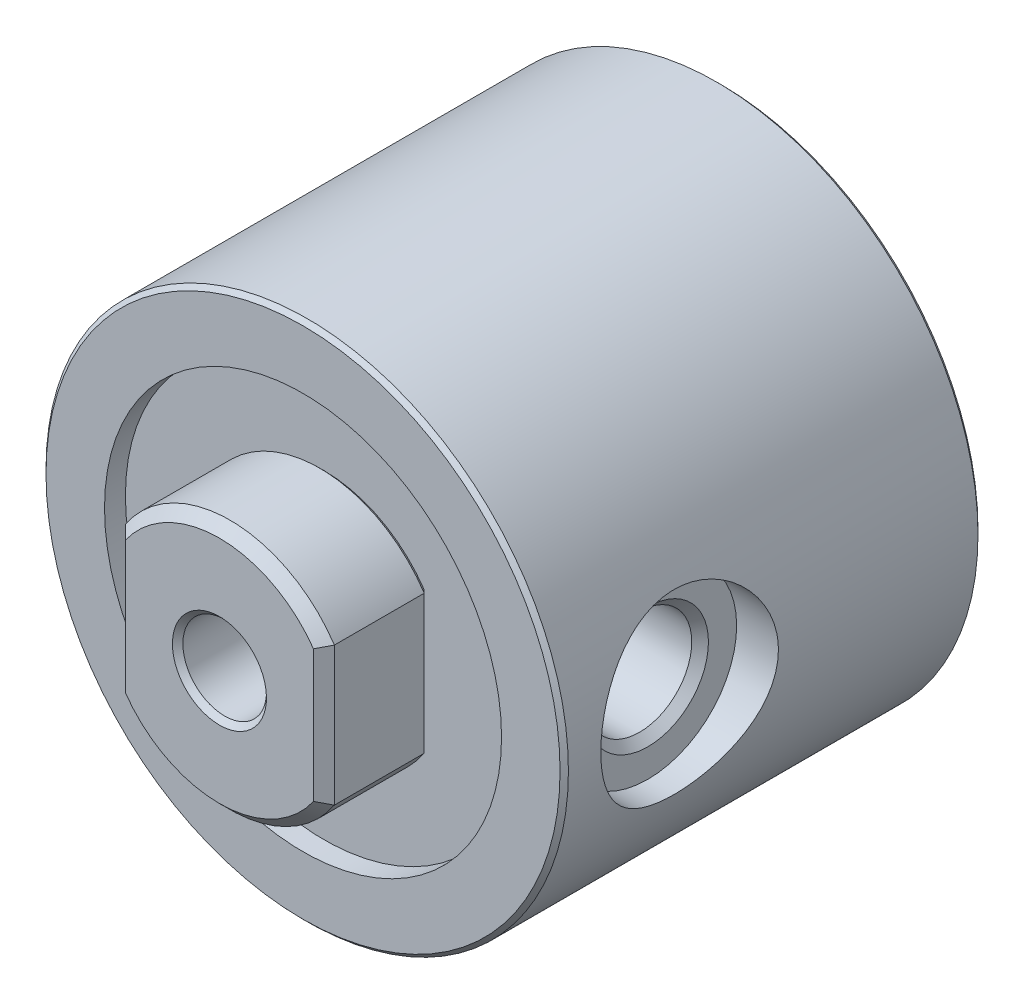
ISO-10303-21;
HEADER;
FILE_DESCRIPTION(('STEP AP214'),'2;1');
FILE_NAME('part.step','',(''),(''),'','','');
FILE_SCHEMA(('AUTOMOTIVE_DESIGN { 1 0 10303 214 1 1 1 1 }'));
ENDSEC;
DATA;
#1=APPLICATION_CONTEXT('core data for automotive mechanical design processes');
#2=APPLICATION_PROTOCOL_DEFINITION('international standard','automotive_design',2000,#1);
#3=PRODUCT_CONTEXT('',#1,'mechanical');
#4=PRODUCT('Part','Part','',(#3));
#5=PRODUCT_RELATED_PRODUCT_CATEGORY('part','',(#4));
#6=PRODUCT_DEFINITION_FORMATION('','',#4);
#7=PRODUCT_DEFINITION_CONTEXT('part definition',#1,'design');
#8=PRODUCT_DEFINITION('design','',#6,#7);
#9=PRODUCT_DEFINITION_SHAPE('','',#8);
#10=(LENGTH_UNIT() NAMED_UNIT(*) SI_UNIT(.MILLI.,.METRE.));
#11=(NAMED_UNIT(*) PLANE_ANGLE_UNIT() SI_UNIT($,.RADIAN.));
#12=(NAMED_UNIT(*) SI_UNIT($,.STERADIAN.) SOLID_ANGLE_UNIT());
#13=UNCERTAINTY_MEASURE_WITH_UNIT(LENGTH_MEASURE(1.E-05),#10,'distance_accuracy_value','');
#14=(GEOMETRIC_REPRESENTATION_CONTEXT(3) GLOBAL_UNCERTAINTY_ASSIGNED_CONTEXT((#13)) GLOBAL_UNIT_ASSIGNED_CONTEXT((#10,
#11,#12)) REPRESENTATION_CONTEXT('',''));
#15=CARTESIAN_POINT('',(0.,0.,0.));
#16=DIRECTION('',(0.,0.,1.));
#17=DIRECTION('',(1.,0.,0.));
#18=AXIS2_PLACEMENT_3D('',#15,#16,#17);
#19=CARTESIAN_POINT('',(10.5,0.,14.));
#20=DIRECTION('',(-1.,0.,0.));
#21=DIRECTION('',(0.,-1.,0.));
#22=AXIS2_PLACEMENT_3D('',#19,#20,#21);
#23=PLANE('',#22);
#24=CARTESIAN_POINT('',(10.5,0.,14.));
#25=DIRECTION('',(1.,0.,0.));
#26=DIRECTION('',(0.,0.,-1.));
#27=AXIS2_PLACEMENT_3D('',#24,#25,#26);
#28=CIRCLE('',#27,2.9);
#29=CARTESIAN_POINT('',(10.5,0.,11.1));
#30=VERTEX_POINT('',#29);
#31=EDGE_CURVE('E158',#30,#30,#28,.T.);
#32=ORIENTED_EDGE('',*,*,#31,.F.);
#33=EDGE_LOOP('',(#32));
#34=FACE_BOUND('',#33,.T.);
#35=CARTESIAN_POINT('',(10.5,0.,14.));
#36=DIRECTION('',(-1.,0.,0.));
#37=DIRECTION('',(0.,-1.,0.));
#38=AXIS2_PLACEMENT_3D('',#35,#36,#37);
#39=CIRCLE('',#38,4.25);
#40=CARTESIAN_POINT('',(10.5,-4.25,14.));
#41=VERTEX_POINT('',#40);
#42=EDGE_CURVE('E162',#41,#41,#39,.T.);
#43=ORIENTED_EDGE('',*,*,#42,.F.);
#44=EDGE_LOOP('',(#43));
#45=FACE_BOUND('',#44,.T.);
#46=ADVANCED_FACE('F14',(#34,#45),#23,.F.);
#47=CARTESIAN_POINT('',(10.5,0.,14.));
#48=DIRECTION('',(1.,0.,0.));
#49=DIRECTION('',(0.,0.,-1.));
#50=AXIS2_PLACEMENT_3D('',#47,#48,#49);
#51=CONICAL_SURFACE('',#50,2.9,0.785398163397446);
#52=CARTESIAN_POINT('',(10.1,0.,14.));
#53=DIRECTION('',(1.,0.,0.));
#54=DIRECTION('',(0.,-1.,0.));
#55=AXIS2_PLACEMENT_3D('',#52,#53,#54);
#56=CIRCLE('',#55,2.5);
#57=CARTESIAN_POINT('',(10.1,-2.5,14.));
#58=VERTEX_POINT('',#57);
#59=EDGE_CURVE('E168',#58,#58,#56,.F.);
#60=ORIENTED_EDGE('',*,*,#59,.T.);
#61=EDGE_LOOP('',(#60));
#62=FACE_BOUND('',#61,.T.);
#63=ORIENTED_EDGE('',*,*,#31,.T.);
#64=EDGE_LOOP('',(#63));
#65=FACE_BOUND('',#64,.T.);
#66=ADVANCED_FACE('F201',(#62,#65),#51,.F.);
#67=CARTESIAN_POINT('',(2.5,0.,14.));
#68=DIRECTION('',(1.,0.,0.));
#69=DIRECTION('',(0.,0.,-1.));
#70=AXIS2_PLACEMENT_3D('',#67,#68,#69);
#71=CYLINDRICAL_SURFACE('',#70,4.25);
#72=CARTESIAN_POINT('',(12.5,0.,9.75));
#73=CARTESIAN_POINT('',(12.5000013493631,-0.2316293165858,9.74999796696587));
#74=CARTESIAN_POINT('',(12.493502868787,-0.463244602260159,9.76899733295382));
#75=CARTESIAN_POINT('',(12.4682205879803,-0.919637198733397,9.84424894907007));
#76=CARTESIAN_POINT('',(12.4494359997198,-1.14441406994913,9.90050358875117));
#77=CARTESIAN_POINT('',(12.4016188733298,-1.58048439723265,10.0481034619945));
#78=CARTESIAN_POINT('',(12.3726038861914,-1.79180021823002,10.139388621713));
#79=CARTESIAN_POINT('',(12.3072763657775,-2.1961203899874,10.3541815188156));
#80=CARTESIAN_POINT('',(12.270962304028,-2.38912089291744,10.4776960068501));
#81=CARTESIAN_POINT('',(12.1933910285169,-2.75825261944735,10.7580893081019));
#82=CARTESIAN_POINT('',(12.1520119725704,-2.93363688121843,10.9159175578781));
#83=CARTESIAN_POINT('',(12.069633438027,-3.25602333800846,11.2584402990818));
#84=CARTESIAN_POINT('',(12.0286340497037,-3.40301894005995,11.4431410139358));
#85=CARTESIAN_POINT('',(11.9503048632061,-3.66879190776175,11.8409772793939));
#86=CARTESIAN_POINT('',(11.9131228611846,-3.78658554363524,12.0548019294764));
#87=CARTESIAN_POINT('',(11.8484975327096,-3.98421855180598,12.500694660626));
#88=CARTESIAN_POINT('',(11.8210510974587,-4.06407004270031,12.7327568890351));
#89=CARTESIAN_POINT('',(11.7802904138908,-4.180727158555,13.2000245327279));
#90=CARTESIAN_POINT('',(11.7665167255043,-4.21893677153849,13.4348381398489));
#91=CARTESIAN_POINT('',(11.7533040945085,-4.2556150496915,13.9079165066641));
#92=CARTESIAN_POINT('',(11.7538605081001,-4.25409658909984,14.1461801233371));
#93=CARTESIAN_POINT('',(11.7688435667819,-4.21244934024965,14.6072949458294));
#94=CARTESIAN_POINT('',(11.7826060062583,-4.1741694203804,14.8303385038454));
#95=CARTESIAN_POINT('',(11.8213609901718,-4.06310816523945,15.266625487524));
#96=CARTESIAN_POINT('',(11.8463549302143,-3.99032254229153,15.4798676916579));
#97=CARTESIAN_POINT('',(11.9052184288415,-3.81113653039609,15.8946323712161));
#98=CARTESIAN_POINT('',(11.9392282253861,-3.70419900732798,16.0959020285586));
#99=CARTESIAN_POINT('',(12.0122344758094,-3.46011773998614,16.4782170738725));
#100=CARTESIAN_POINT('',(12.0512324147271,-3.32296499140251,16.6592564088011));
#101=CARTESIAN_POINT('',(12.1324166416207,-3.01353124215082,17.006338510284));
#102=CARTESIAN_POINT('',(12.1746609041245,-2.83974395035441,17.1710276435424));
#103=CARTESIAN_POINT('',(12.2557250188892,-2.4665017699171,17.469285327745));
#104=CARTESIAN_POINT('',(12.294544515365,-2.26704421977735,17.602850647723));
#105=CARTESIAN_POINT('',(12.3649312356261,-1.84516436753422,17.8362182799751));
#106=CARTESIAN_POINT('',(12.3964165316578,-1.62251944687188,17.9356445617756));
#107=CARTESIAN_POINT('',(12.4479909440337,-1.16233553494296,18.0952073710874));
#108=CARTESIAN_POINT('',(12.4680841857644,-0.924801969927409,18.1553581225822));
#109=CARTESIAN_POINT('',(12.4939206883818,-0.453032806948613,18.2322333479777));
#110=CARTESIAN_POINT('',(12.5002675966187,-0.219127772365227,18.2507859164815));
#111=CARTESIAN_POINT('',(12.499715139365,0.248508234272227,18.2491633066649));
#112=CARTESIAN_POINT('',(12.4928181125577,0.482239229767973,18.2289949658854));
#113=CARTESIAN_POINT('',(12.4669514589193,0.935487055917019,18.1519417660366));
#114=CARTESIAN_POINT('',(12.4483547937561,1.15521999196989,18.0961904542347));
#115=CARTESIAN_POINT('',(12.4013331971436,1.58211571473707,17.950982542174));
#116=CARTESIAN_POINT('',(12.3729070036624,1.78927688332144,17.8615216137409));
#117=CARTESIAN_POINT('',(12.3081499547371,2.19135854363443,17.6487765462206));
#118=CARTESIAN_POINT('',(12.2716272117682,2.38580051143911,17.524648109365));
#119=CARTESIAN_POINT('',(12.1948041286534,2.75168306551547,17.2470771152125));
#120=CARTESIAN_POINT('',(12.1545025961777,2.9231163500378,17.0936252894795));
#121=CARTESIAN_POINT('',(12.0722386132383,3.24657351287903,16.7531724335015));
#122=CARTESIAN_POINT('',(12.0302879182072,3.39729328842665,16.564926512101));
#123=CARTESIAN_POINT('',(11.9514023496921,3.66518020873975,16.1649221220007));
#124=CARTESIAN_POINT('',(11.914467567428,3.78234674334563,15.9531632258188));
#125=CARTESIAN_POINT('',(11.8501336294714,3.97933669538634,15.5118433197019));
#126=CARTESIAN_POINT('',(11.8227223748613,4.05920753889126,15.282305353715));
#127=CARTESIAN_POINT('',(11.7809981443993,4.17877629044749,14.8118824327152));
#128=CARTESIAN_POINT('',(11.7666789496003,4.21849327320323,14.5710029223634));
#129=CARTESIAN_POINT('',(11.7534862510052,4.25510290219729,14.0985747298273));
#130=CARTESIAN_POINT('',(11.7538288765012,4.25416884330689,13.867214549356));
#131=CARTESIAN_POINT('',(11.7679720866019,4.21488538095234,13.4081334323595));
#132=CARTESIAN_POINT('',(11.781771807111,4.17653837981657,13.1804122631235));
#133=CARTESIAN_POINT('',(11.8206793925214,4.06508169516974,12.7397513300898));
#134=CARTESIAN_POINT('',(11.8455487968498,3.99270334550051,12.5266038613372));
#135=CARTESIAN_POINT('',(11.9036971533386,3.81583792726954,12.1153188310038));
#136=CARTESIAN_POINT('',(11.9369780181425,3.71134355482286,11.9171846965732));
#137=CARTESIAN_POINT('',(12.0100690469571,3.46772073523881,11.5318662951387));
#138=CARTESIAN_POINT('',(12.0501058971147,3.32724348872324,11.3455781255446));
#139=CARTESIAN_POINT('',(12.1312763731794,3.01789256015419,10.9985180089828));
#140=CARTESIAN_POINT('',(12.1724103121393,2.84901069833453,10.8377534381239));
#141=CARTESIAN_POINT('',(12.2531734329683,2.4793015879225,10.5396203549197));
#142=CARTESIAN_POINT('',(12.2926709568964,2.27744544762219,10.4034874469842));
#143=CARTESIAN_POINT('',(12.3638575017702,1.85239769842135,10.1672194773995));
#144=CARTESIAN_POINT('',(12.3955481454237,1.62921053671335,10.0670769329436));
#145=CARTESIAN_POINT('',(12.4466848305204,1.1749855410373,9.90880045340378));
#146=CARTESIAN_POINT('',(12.4664836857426,0.944413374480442,9.84944765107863));
#147=CARTESIAN_POINT('',(12.4931386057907,0.475887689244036,9.7700544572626));
#148=CARTESIAN_POINT('',(12.4999986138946,0.237936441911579,9.75000208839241));
#149=CARTESIAN_POINT('',(12.5,0.,9.75));
#150=B_SPLINE_CURVE_WITH_KNOTS('',3,(#72,#73,#74,#75,#76,#77,#78,#79,#80,#81,#82,#83,#84,#85,
#86,#87,#88,#89,#90,#91,#92,#93,#94,#95,#96,#97,#98,#99,#100,#101,#102,#103,#104,#105,#106,#107,
#108,#109,#110,#111,#112,#113,#114,#115,#116,#117,#118,#119,#120,#121,#122,#123,#124,#125,#126,
#127,#128,#129,#130,#131,#132,#133,#134,#135,#136,#137,#138,#139,#140,#141,#142,#143,#144,#145,
#146,#147,#148,#149),.UNSPECIFIED.,.T.,.F.,(4,2,2,2,2,2,2,2,2,2,2,2,2,2,2,2,2,2,2,2,2,2,2,2,2,2,
2,2,2,2,2,2,2,2,2,2,2,2,4),(0.,0.694012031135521,1.38806858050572,2.08094017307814,
2.77395700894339,3.48937549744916,4.20495993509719,4.94210626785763,5.67901699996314,
6.39023024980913,7.10121302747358,7.77821403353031,8.45529918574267,9.14360628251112,
9.83211877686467,10.5581272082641,11.2842109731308,12.0180534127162,12.7516299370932,
13.4522781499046,14.1528026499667,14.8320547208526,15.5113940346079,16.2089885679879,
16.9068039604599,17.6376748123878,18.3685589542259,19.0985111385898,19.8281164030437,
20.5187658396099,21.2093709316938,21.8857695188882,22.5623220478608,23.2693695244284,
23.976620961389,24.7129879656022,25.4492017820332,26.1623287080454,26.8752382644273),.UNSPECIFIED.);
#151=CARTESIAN_POINT('',(12.5,0.,9.75));
#152=VERTEX_POINT('',#151);
#153=EDGE_CURVE('E154',#152,#152,#150,.T.);
#154=ORIENTED_EDGE('',*,*,#153,.F.);
#155=EDGE_LOOP('',(#154));
#156=FACE_BOUND('',#155,.T.);
#157=ORIENTED_EDGE('',*,*,#42,.T.);
#158=EDGE_LOOP('',(#157));
#159=FACE_BOUND('',#158,.T.);
#160=ADVANCED_FACE('F196',(#156,#159),#71,.F.);
#161=CARTESIAN_POINT('',(0.,0.,20.));
#162=DIRECTION('',(0.,0.,1.));
#163=DIRECTION('',(1.,0.,0.));
#164=AXIS2_PLACEMENT_3D('',#161,#162,#163);
#165=CYLINDRICAL_SURFACE('',#164,12.5);
#166=CARTESIAN_POINT('',(0.,0.,0.2));
#167=DIRECTION('',(0.,0.,1.));
#168=DIRECTION('',(1.,0.,0.));
#169=AXIS2_PLACEMENT_3D('',#166,#167,#168);
#170=CIRCLE('',#169,12.5);
#171=CARTESIAN_POINT('',(12.5,0.,0.2));
#172=VERTEX_POINT('',#171);
#173=EDGE_CURVE('E594',#172,#172,#170,.T.);
#174=ORIENTED_EDGE('',*,*,#173,.T.);
#175=EDGE_LOOP('',(#174));
#176=FACE_BOUND('',#175,.T.);
#177=CARTESIAN_POINT('',(0.,0.,19.8));
#178=DIRECTION('',(0.,0.,-1.));
#179=DIRECTION('',(-1.,0.,0.));
#180=AXIS2_PLACEMENT_3D('',#177,#178,#179);
#181=CIRCLE('',#180,12.5);
#182=CARTESIAN_POINT('',(-12.5,0.,19.8));
#183=VERTEX_POINT('',#182);
#184=EDGE_CURVE('E597',#183,#183,#181,.T.);
#185=ORIENTED_EDGE('',*,*,#184,.T.);
#186=EDGE_LOOP('',(#185));
#187=FACE_BOUND('',#186,.T.);
#188=ORIENTED_EDGE('',*,*,#153,.T.);
#189=EDGE_LOOP('',(#188));
#190=FACE_BOUND('',#189,.T.);
#191=ADVANCED_FACE('F192',(#176,#187,#190),#165,.T.);
#192=CARTESIAN_POINT('',(0.,0.,0.2));
#193=DIRECTION('',(0.,0.,1.));
#194=DIRECTION('',(1.,0.,0.));
#195=AXIS2_PLACEMENT_3D('',#192,#193,#194);
#196=CONICAL_SURFACE('',#195,12.5,0.785398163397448);
#197=CARTESIAN_POINT('',(0.,0.,0.));
#198=DIRECTION('',(0.,0.,1.));
#199=DIRECTION('',(1.,0.,0.));
#200=AXIS2_PLACEMENT_3D('',#197,#198,#199);
#201=CIRCLE('',#200,12.3);
#202=CARTESIAN_POINT('',(12.3,0.,0.));
#203=VERTEX_POINT('',#202);
#204=EDGE_CURVE('E23',#203,#203,#201,.F.);
#205=ORIENTED_EDGE('',*,*,#204,.F.);
#206=EDGE_LOOP('',(#205));
#207=FACE_BOUND('',#206,.T.);
#208=ORIENTED_EDGE('',*,*,#173,.F.);
#209=EDGE_LOOP('',(#208));
#210=FACE_BOUND('',#209,.T.);
#211=ADVANCED_FACE('F204',(#207,#210),#196,.T.);
#212=CARTESIAN_POINT('',(0.,0.,20.));
#213=DIRECTION('',(0.,0.,-1.));
#214=DIRECTION('',(-1.,0.,0.));
#215=AXIS2_PLACEMENT_3D('',#212,#213,#214);
#216=CONICAL_SURFACE('',#215,12.3,0.785398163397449);
#217=ORIENTED_EDGE('',*,*,#184,.F.);
#218=EDGE_LOOP('',(#217));
#219=FACE_BOUND('',#218,.T.);
#220=CARTESIAN_POINT('',(0.,0.,20.));
#221=DIRECTION('',(0.,0.,-1.));
#222=DIRECTION('',(-1.,0.,0.));
#223=AXIS2_PLACEMENT_3D('',#220,#221,#222);
#224=CIRCLE('',#223,12.3);
#225=CARTESIAN_POINT('',(-12.3,0.,20.));
#226=VERTEX_POINT('',#225);
#227=EDGE_CURVE('E9',#226,#226,#224,.F.);
#228=ORIENTED_EDGE('',*,*,#227,.F.);
#229=EDGE_LOOP('',(#228));
#230=FACE_BOUND('',#229,.T.);
#231=ADVANCED_FACE('F219',(#219,#230),#216,.T.);
#232=CARTESIAN_POINT('',(0.,12.5,0.));
#233=DIRECTION('',(0.,0.,1.));
#234=DIRECTION('',(1.,0.,0.));
#235=AXIS2_PLACEMENT_3D('',#232,#233,#234);
#236=PLANE('',#235);
#237=ORIENTED_EDGE('',*,*,#204,.T.);
#238=EDGE_LOOP('',(#237));
#239=FACE_BOUND('',#238,.T.);
#240=CARTESIAN_POINT('',(0.,0.,0.));
#241=DIRECTION('',(0.,0.,1.));
#242=DIRECTION('',(1.,0.,0.));
#243=AXIS2_PLACEMENT_3D('',#240,#241,#242);
#244=CIRCLE('',#243,11.5);
#245=CARTESIAN_POINT('',(11.5,0.,0.));
#246=VERTEX_POINT('',#245);
#247=EDGE_CURVE('E600',#246,#246,#244,.T.);
#248=ORIENTED_EDGE('',*,*,#247,.T.);
#249=EDGE_LOOP('',(#248));
#250=FACE_BOUND('',#249,.T.);
#251=ADVANCED_FACE('F209',(#239,#250),#236,.F.);
#252=CARTESIAN_POINT('',(0.,12.5,20.));
#253=DIRECTION('',(0.,0.,-1.));
#254=DIRECTION('',(-1.,0.,0.));
#255=AXIS2_PLACEMENT_3D('',#252,#253,#254);
#256=PLANE('',#255);
#257=ORIENTED_EDGE('',*,*,#227,.T.);
#258=EDGE_LOOP('',(#257));
#259=FACE_BOUND('',#258,.T.);
#260=CARTESIAN_POINT('',(0.,0.,20.));
#261=DIRECTION('',(0.,0.,1.));
#262=DIRECTION('',(1.,0.,0.));
#263=AXIS2_PLACEMENT_3D('',#260,#261,#262);
#264=CIRCLE('',#263,9.5);
#265=CARTESIAN_POINT('',(9.5,0.,20.));
#266=VERTEX_POINT('',#265);
#267=EDGE_CURVE('E190',#266,#266,#264,.T.);
#268=ORIENTED_EDGE('',*,*,#267,.F.);
#269=EDGE_LOOP('',(#268));
#270=FACE_BOUND('',#269,.T.);
#271=ADVANCED_FACE('F203',(#259,#270),#256,.F.);
#272=CARTESIAN_POINT('',(0.,0.,20.));
#273=DIRECTION('',(0.,0.,1.));
#274=DIRECTION('',(1.,0.,0.));
#275=AXIS2_PLACEMENT_3D('',#272,#273,#274);
#276=CYLINDRICAL_SURFACE('',#275,11.5);
#277=ORIENTED_EDGE('',*,*,#247,.F.);
#278=EDGE_LOOP('',(#277));
#279=FACE_BOUND('',#278,.T.);
#280=CARTESIAN_POINT('',(0.,0.,9.6));
#281=DIRECTION('',(0.,0.,-1.));
#282=DIRECTION('',(-1.,0.,0.));
#283=AXIS2_PLACEMENT_3D('',#280,#281,#282);
#284=CIRCLE('',#283,11.5);
#285=CARTESIAN_POINT('',(-11.5,0.,9.6));
#286=VERTEX_POINT('',#285);
#287=EDGE_CURVE('E180',#286,#286,#284,.T.);
#288=ORIENTED_EDGE('',*,*,#287,.F.);
#289=EDGE_LOOP('',(#288));
#290=FACE_BOUND('',#289,.T.);
#291=ADVANCED_FACE('F208',(#279,#290),#276,.F.);
#292=CARTESIAN_POINT('',(0.,0.,20.));
#293=DIRECTION('',(0.,0.,1.));
#294=DIRECTION('',(1.,0.,0.));
#295=AXIS2_PLACEMENT_3D('',#292,#293,#294);
#296=CYLINDRICAL_SURFACE('',#295,9.5);
#297=CARTESIAN_POINT('',(0.,0.,19.));
#298=DIRECTION('',(0.,0.,1.));
#299=DIRECTION('',(1.,0.,0.));
#300=AXIS2_PLACEMENT_3D('',#297,#298,#299);
#301=CIRCLE('',#300,9.5);
#302=CARTESIAN_POINT('',(9.5,0.,19.));
#303=VERTEX_POINT('',#302);
#304=EDGE_CURVE('E602',#303,#303,#301,.T.);
#305=ORIENTED_EDGE('',*,*,#304,.F.);
#306=EDGE_LOOP('',(#305));
#307=FACE_BOUND('',#306,.T.);
#308=ORIENTED_EDGE('',*,*,#267,.T.);
#309=EDGE_LOOP('',(#308));
#310=FACE_BOUND('',#309,.T.);
#311=ADVANCED_FACE('F211',(#307,#310),#296,.F.);
#312=CARTESIAN_POINT('',(0.,0.,19.));
#313=DIRECTION('',(0.,0.,1.));
#314=DIRECTION('',(0.,1.,0.));
#315=AXIS2_PLACEMENT_3D('',#312,#313,#314);
#316=PLANE('',#315);
#317=CARTESIAN_POINT('',(0.,0.,19.));
#318=DIRECTION('',(0.,0.,1.));
#319=DIRECTION('',(0.,-1.,0.));
#320=AXIS2_PLACEMENT_3D('',#317,#318,#319);
#321=CIRCLE('',#320,5.8);
#322=CARTESIAN_POINT('',(4.8,-3.25576411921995,19.));
#323=VERTEX_POINT('',#322);
#324=CARTESIAN_POINT('',(-4.8,-3.25576411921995,19.));
#325=VERTEX_POINT('',#324);
#326=EDGE_CURVE('E127',#323,#325,#321,.F.);
#327=ORIENTED_EDGE('',*,*,#326,.T.);
#328=DIRECTION('',(0.,1.,0.));
#329=VECTOR('',#328,1.);
#330=CARTESIAN_POINT('',(-4.8,-3.5,19.));
#331=LINE('',#330,#329);
#332=CARTESIAN_POINT('',(-4.8,3.25576411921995,19.));
#333=VERTEX_POINT('',#332);
#334=EDGE_CURVE('E130',#325,#333,#331,.T.);
#335=ORIENTED_EDGE('',*,*,#334,.T.);
#336=CARTESIAN_POINT('',(0.,0.,19.));
#337=DIRECTION('',(0.,0.,1.));
#338=DIRECTION('',(0.,-1.,0.));
#339=AXIS2_PLACEMENT_3D('',#336,#337,#338);
#340=CIRCLE('',#339,5.8);
#341=CARTESIAN_POINT('',(4.8,3.25576411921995,19.));
#342=VERTEX_POINT('',#341);
#343=EDGE_CURVE('E132',#333,#342,#340,.F.);
#344=ORIENTED_EDGE('',*,*,#343,.T.);
#345=DIRECTION('',(0.,-1.,0.));
#346=VECTOR('',#345,1.);
#347=CARTESIAN_POINT('',(4.8,-3.5,19.));
#348=LINE('',#347,#346);
#349=EDGE_CURVE('E135',#342,#323,#348,.T.);
#350=ORIENTED_EDGE('',*,*,#349,.T.);
#351=EDGE_LOOP('',(#327,#335,#344,#350));
#352=FACE_BOUND('',#351,.T.);
#353=ORIENTED_EDGE('',*,*,#304,.T.);
#354=EDGE_LOOP('',(#353));
#355=FACE_BOUND('',#354,.T.);
#356=ADVANCED_FACE('F16',(#352,#355),#316,.T.);
#357=CARTESIAN_POINT('',(0.,0.,19.));
#358=DIRECTION('',(0.,0.,1.));
#359=DIRECTION('',(0.,-1.,0.));
#360=AXIS2_PLACEMENT_3D('',#357,#358,#359);
#361=CONICAL_SURFACE('',#360,5.8,0.785398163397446);
#362=CARTESIAN_POINT('',(-5.,-3.31662479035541,19.2));
#363=CARTESIAN_POINT('',(-4.96665300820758,-3.30657111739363,19.1666530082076));
#364=CARTESIAN_POINT('',(-4.93331284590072,-3.29647255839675,19.1333128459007));
#365=CARTESIAN_POINT('',(-4.86664617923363,-3.27618566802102,19.0666461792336));
#366=CARTESIAN_POINT('',(-4.83331967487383,-3.26599733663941,19.0333196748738));
#367=CARTESIAN_POINT('',(-4.8,-3.25576411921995,19.));
#368=B_SPLINE_CURVE_WITH_KNOTS('',3,(#362,#363,#364,#365,#366,#367),.UNSPECIFIED.,.F.,.F.,(4,2,
4),(0.,0.144658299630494,0.289316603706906),.UNSPECIFIED.);
#369=CARTESIAN_POINT('',(-5.,-3.31662479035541,19.2));
#370=VERTEX_POINT('',#369);
#371=EDGE_CURVE('E310',#370,#325,#368,.T.);
#372=ORIENTED_EDGE('',*,*,#371,.T.);
#373=ORIENTED_EDGE('',*,*,#326,.F.);
#374=CARTESIAN_POINT('',(4.8,-3.25576411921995,19.));
#375=CARTESIAN_POINT('',(4.83331967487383,-3.26599733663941,19.0333196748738));
#376=CARTESIAN_POINT('',(4.86664617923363,-3.27618566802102,19.0666461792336));
#377=CARTESIAN_POINT('',(4.93331284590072,-3.29647255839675,19.1333128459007));
#378=CARTESIAN_POINT('',(4.96665300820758,-3.30657111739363,19.1666530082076));
#379=CARTESIAN_POINT('',(5.,-3.31662479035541,19.2));
#380=B_SPLINE_CURVE_WITH_KNOTS('',3,(#374,#375,#376,#377,#378,#379),.UNSPECIFIED.,.F.,.F.,(4,2,
4),(0.,0.144658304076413,0.289316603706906),.UNSPECIFIED.);
#381=CARTESIAN_POINT('',(5.,-3.31662479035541,19.2));
#382=VERTEX_POINT('',#381);
#383=EDGE_CURVE('E566',#382,#323,#380,.F.);
#384=ORIENTED_EDGE('',*,*,#383,.F.);
#385=CARTESIAN_POINT('',(0.,0.,19.2));
#386=DIRECTION('',(0.,0.,1.));
#387=DIRECTION('',(0.,-1.,0.));
#388=AXIS2_PLACEMENT_3D('',#385,#386,#387);
#389=CIRCLE('',#388,6.);
#390=EDGE_CURVE('E143',#370,#382,#389,.T.);
#391=ORIENTED_EDGE('',*,*,#390,.F.);
#392=EDGE_LOOP('',(#372,#373,#384,#391));
#393=FACE_BOUND('',#392,.T.);
#394=ADVANCED_FACE('F272',(#393),#361,.T.);
#395=CARTESIAN_POINT('',(-4.8,-3.5,19.));
#396=DIRECTION('',(0.707106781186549,0.,0.707106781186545));
#397=DIRECTION('',(-0.707106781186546,0.,0.707106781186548));
#398=AXIS2_PLACEMENT_3D('',#395,#396,#397);
#399=PLANE('',#398);
#400=ORIENTED_EDGE('',*,*,#371,.F.);
#401=DIRECTION('',(0.,-1.,0.));
#402=VECTOR('',#401,1.);
#403=CARTESIAN_POINT('',(-5.,7.41559238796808,19.2));
#404=LINE('',#403,#402);
#405=CARTESIAN_POINT('',(-5.,3.31662479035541,19.2));
#406=VERTEX_POINT('',#405);
#407=EDGE_CURVE('E31',#406,#370,#404,.T.);
#408=ORIENTED_EDGE('',*,*,#407,.F.);
#409=CARTESIAN_POINT('',(-5.,3.31662479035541,19.2));
#410=CARTESIAN_POINT('',(-4.96665300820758,3.30657111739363,19.1666530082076));
#411=CARTESIAN_POINT('',(-4.93331284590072,3.29647255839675,19.1333128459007));
#412=CARTESIAN_POINT('',(-4.86664617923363,3.27618566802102,19.0666461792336));
#413=CARTESIAN_POINT('',(-4.83331967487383,3.26599733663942,19.0333196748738));
#414=CARTESIAN_POINT('',(-4.8,3.25576411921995,19.));
#415=B_SPLINE_CURVE_WITH_KNOTS('',3,(#409,#410,#411,#412,#413,#414),.UNSPECIFIED.,.F.,.F.,(4,2,
4),(0.,0.144658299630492,0.289316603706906),.UNSPECIFIED.);
#416=EDGE_CURVE('E307',#333,#406,#415,.F.);
#417=ORIENTED_EDGE('',*,*,#416,.F.);
#418=ORIENTED_EDGE('',*,*,#334,.F.);
#419=EDGE_LOOP('',(#400,#408,#417,#418));
#420=FACE_BOUND('',#419,.T.);
#421=ADVANCED_FACE('F514',(#420),#399,.F.);
#422=CARTESIAN_POINT('',(0.,0.,19.));
#423=DIRECTION('',(0.,0.,1.));
#424=DIRECTION('',(0.,-1.,0.));
#425=AXIS2_PLACEMENT_3D('',#422,#423,#424);
#426=CONICAL_SURFACE('',#425,5.8,0.785398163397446);
#427=ORIENTED_EDGE('',*,*,#416,.T.);
#428=CARTESIAN_POINT('',(0.,0.,19.2));
#429=DIRECTION('',(0.,0.,1.));
#430=DIRECTION('',(0.,-1.,0.));
#431=AXIS2_PLACEMENT_3D('',#428,#429,#430);
#432=CIRCLE('',#431,6.);
#433=CARTESIAN_POINT('',(5.,3.31662479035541,19.2));
#434=VERTEX_POINT('',#433);
#435=EDGE_CURVE('E39',#434,#406,#432,.T.);
#436=ORIENTED_EDGE('',*,*,#435,.F.);
#437=CARTESIAN_POINT('',(5.,3.31662479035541,19.2));
#438=CARTESIAN_POINT('',(4.96665300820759,3.30657111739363,19.1666530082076));
#439=CARTESIAN_POINT('',(4.93331284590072,3.29647255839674,19.1333128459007));
#440=CARTESIAN_POINT('',(4.86664617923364,3.27618566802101,19.0666461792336));
#441=CARTESIAN_POINT('',(4.83331967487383,3.26599733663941,19.0333196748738));
#442=CARTESIAN_POINT('',(4.8,3.25576411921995,19.));
#443=B_SPLINE_CURVE_WITH_KNOTS('',3,(#437,#438,#439,#440,#441,#442),.UNSPECIFIED.,.F.,.F.,(4,2,
4),(0.,0.144658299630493,0.289316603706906),.UNSPECIFIED.);
#444=EDGE_CURVE('E577',#342,#434,#443,.F.);
#445=ORIENTED_EDGE('',*,*,#444,.F.);
#446=ORIENTED_EDGE('',*,*,#343,.F.);
#447=EDGE_LOOP('',(#427,#436,#445,#446));
#448=FACE_BOUND('',#447,.T.);
#449=ADVANCED_FACE('F271',(#448),#426,.T.);
#450=CARTESIAN_POINT('',(4.8,-3.5,19.));
#451=DIRECTION('',(-0.707106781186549,0.,0.707106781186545));
#452=DIRECTION('',(-0.707106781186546,0.,-0.707106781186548));
#453=AXIS2_PLACEMENT_3D('',#450,#451,#452);
#454=PLANE('',#453);
#455=ORIENTED_EDGE('',*,*,#444,.T.);
#456=DIRECTION('',(0.,1.,0.));
#457=VECTOR('',#456,1.);
#458=CARTESIAN_POINT('',(5.,7.41559238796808,19.2));
#459=LINE('',#458,#457);
#460=EDGE_CURVE('E138',#382,#434,#459,.T.);
#461=ORIENTED_EDGE('',*,*,#460,.F.);
#462=ORIENTED_EDGE('',*,*,#383,.T.);
#463=ORIENTED_EDGE('',*,*,#349,.F.);
#464=EDGE_LOOP('',(#455,#461,#462,#463));
#465=FACE_BOUND('',#464,.T.);
#466=ADVANCED_FACE('F217',(#465),#454,.F.);
#467=CARTESIAN_POINT('',(0.,0.,-0.499999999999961));
#468=DIRECTION('',(0.,0.,-1.));
#469=DIRECTION('',(0.,1.,0.));
#470=AXIS2_PLACEMENT_3D('',#467,#468,#469);
#471=CYLINDRICAL_SURFACE('',#470,6.);
#472=DIRECTION('',(0.,0.,-1.));
#473=VECTOR('',#472,1.);
#474=CARTESIAN_POINT('',(-5.,-3.31662479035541,-0.499999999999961));
#475=LINE('',#474,#473);
#476=CARTESIAN_POINT('',(-5.,-3.31662479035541,23.5));
#477=VERTEX_POINT('',#476);
#478=EDGE_CURVE('E295',#477,#370,#475,.T.);
#479=ORIENTED_EDGE('',*,*,#478,.T.);
#480=ORIENTED_EDGE('',*,*,#390,.T.);
#481=DIRECTION('',(0.,0.,-1.));
#482=VECTOR('',#481,1.);
#483=CARTESIAN_POINT('',(5.,-3.31662479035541,-0.499999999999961));
#484=LINE('',#483,#482);
#485=CARTESIAN_POINT('',(5.,-3.31662479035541,23.5));
#486=VERTEX_POINT('',#485);
#487=EDGE_CURVE('E112',#382,#486,#484,.F.);
#488=ORIENTED_EDGE('',*,*,#487,.T.);
#489=CARTESIAN_POINT('',(0.,0.,23.5));
#490=DIRECTION('',(0.,0.,-1.));
#491=DIRECTION('',(0.,1.,0.));
#492=AXIS2_PLACEMENT_3D('',#489,#490,#491);
#493=CIRCLE('',#492,6.);
#494=EDGE_CURVE('E125',#486,#477,#493,.T.);
#495=ORIENTED_EDGE('',*,*,#494,.T.);
#496=EDGE_LOOP('',(#479,#480,#488,#495));
#497=FACE_BOUND('',#496,.T.);
#498=ADVANCED_FACE('F262',(#497),#471,.T.);
#499=CARTESIAN_POINT('',(-5.,7.41559238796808,-0.499999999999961));
#500=DIRECTION('',(1.,0.,0.));
#501=DIRECTION('',(0.,0.,1.));
#502=AXIS2_PLACEMENT_3D('',#499,#500,#501);
#503=PLANE('',#502);
#504=DIRECTION('',(0.,0.,-1.));
#505=VECTOR('',#504,1.);
#506=CARTESIAN_POINT('',(-5.,3.31662479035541,-0.499999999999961));
#507=LINE('',#506,#505);
#508=CARTESIAN_POINT('',(-5.,3.31662479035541,23.5));
#509=VERTEX_POINT('',#508);
#510=EDGE_CURVE('E103',#406,#509,#507,.F.);
#511=ORIENTED_EDGE('',*,*,#510,.F.);
#512=ORIENTED_EDGE('',*,*,#407,.T.);
#513=ORIENTED_EDGE('',*,*,#478,.F.);
#514=DIRECTION('',(0.,1.,0.));
#515=VECTOR('',#514,1.);
#516=CARTESIAN_POINT('',(-5.,7.41559238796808,23.5));
#517=LINE('',#516,#515);
#518=EDGE_CURVE('E100',#477,#509,#517,.T.);
#519=ORIENTED_EDGE('',*,*,#518,.T.);
#520=EDGE_LOOP('',(#511,#512,#513,#519));
#521=FACE_BOUND('',#520,.T.);
#522=ADVANCED_FACE('F261',(#521),#503,.F.);
#523=DIRECTION('',(0.,0.,-1.));
#524=VECTOR('',#523,1.);
#525=CARTESIAN_POINT('',(5.,3.31662479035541,-0.499999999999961));
#526=LINE('',#525,#524);
#527=CARTESIAN_POINT('',(5.,3.31662479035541,23.5));
#528=VERTEX_POINT('',#527);
#529=EDGE_CURVE('E110',#528,#434,#526,.T.);
#530=ORIENTED_EDGE('',*,*,#529,.T.);
#531=ORIENTED_EDGE('',*,*,#435,.T.);
#532=ORIENTED_EDGE('',*,*,#510,.T.);
#533=CARTESIAN_POINT('',(0.,0.,23.5));
#534=DIRECTION('',(0.,0.,-1.));
#535=DIRECTION('',(0.,1.,0.));
#536=AXIS2_PLACEMENT_3D('',#533,#534,#535);
#537=CIRCLE('',#536,6.);
#538=EDGE_CURVE('E122',#509,#528,#537,.T.);
#539=ORIENTED_EDGE('',*,*,#538,.T.);
#540=EDGE_LOOP('',(#530,#531,#532,#539));
#541=FACE_BOUND('',#540,.T.);
#542=ADVANCED_FACE('F257',(#541),#471,.T.);
#543=CARTESIAN_POINT('',(5.,7.41559238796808,-0.499999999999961));
#544=DIRECTION('',(-1.,0.,0.));
#545=DIRECTION('',(0.,0.,-1.));
#546=AXIS2_PLACEMENT_3D('',#543,#544,#545);
#547=PLANE('',#546);
#548=ORIENTED_EDGE('',*,*,#487,.F.);
#549=ORIENTED_EDGE('',*,*,#460,.T.);
#550=ORIENTED_EDGE('',*,*,#529,.F.);
#551=DIRECTION('',(0.,-1.,0.));
#552=VECTOR('',#551,1.);
#553=CARTESIAN_POINT('',(5.,7.41559238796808,23.5));
#554=LINE('',#553,#552);
#555=EDGE_CURVE('E119',#528,#486,#554,.T.);
#556=ORIENTED_EDGE('',*,*,#555,.T.);
#557=EDGE_LOOP('',(#548,#549,#550,#556));
#558=FACE_BOUND('',#557,.T.);
#559=ADVANCED_FACE('F260',(#558),#547,.F.);
#560=CARTESIAN_POINT('',(0.,0.,23.5));
#561=DIRECTION('',(0.,0.,-1.));
#562=DIRECTION('',(0.,1.,0.));
#563=AXIS2_PLACEMENT_3D('',#560,#561,#562);
#564=CONICAL_SURFACE('',#563,6.,0.78539816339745);
#565=CARTESIAN_POINT('',(-4.5,-3.16227766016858,24.));
#566=CARTESIAN_POINT('',(-4.583243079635,-3.18858707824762,23.916756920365));
#567=CARTESIAN_POINT('',(-4.66653129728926,-3.21460405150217,23.8334687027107));
#568=CARTESIAN_POINT('',(-4.83319796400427,-3.26605309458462,23.6668020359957));
#569=CARTESIAN_POINT('',(-4.91657641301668,-3.29148516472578,23.5834235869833));
#570=CARTESIAN_POINT('',(-5.,-3.31662479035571,23.5));
#571=B_SPLINE_CURVE_WITH_KNOTS('',3,(#565,#566,#567,#568,#569,#570),.UNSPECIFIED.,.F.,.F.,(4,2,
4),(0.,0.361879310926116,0.723758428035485),.UNSPECIFIED.);
#572=CARTESIAN_POINT('',(-4.4999999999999,-3.16227766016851,24.));
#573=VERTEX_POINT('',#572);
#574=EDGE_CURVE('E97',#573,#477,#571,.T.);
#575=ORIENTED_EDGE('',*,*,#574,.T.);
#576=ORIENTED_EDGE('',*,*,#494,.F.);
#577=CARTESIAN_POINT('',(5.,-3.31662479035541,23.5));
#578=CARTESIAN_POINT('',(4.91657641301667,-3.29148516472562,23.5834235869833));
#579=CARTESIAN_POINT('',(4.83319796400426,-3.26605309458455,23.6668020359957));
#580=CARTESIAN_POINT('',(4.66653129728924,-3.21460405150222,23.8334687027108));
#581=CARTESIAN_POINT('',(4.58324307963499,-3.18858707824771,23.916756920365));
#582=CARTESIAN_POINT('',(4.5,-3.16227766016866,24.));
#583=B_SPLINE_CURVE_WITH_KNOTS('',3,(#577,#578,#579,#580,#581,#582),.UNSPECIFIED.,.F.,.F.,(4,2,
4),(0.,0.361879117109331,0.723758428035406),.UNSPECIFIED.);
#584=CARTESIAN_POINT('',(4.4999999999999,-3.16227766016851,24.));
#585=VERTEX_POINT('',#584);
#586=EDGE_CURVE('E108',#585,#486,#583,.F.);
#587=ORIENTED_EDGE('',*,*,#586,.F.);
#588=CARTESIAN_POINT('',(0.,0.,24.));
#589=DIRECTION('',(0.,0.,-1.));
#590=DIRECTION('',(0.,1.,0.));
#591=AXIS2_PLACEMENT_3D('',#588,#589,#590);
#592=CIRCLE('',#591,5.5);
#593=EDGE_CURVE('E87',#573,#585,#592,.F.);
#594=ORIENTED_EDGE('',*,*,#593,.F.);
#595=EDGE_LOOP('',(#575,#576,#587,#594));
#596=FACE_BOUND('',#595,.T.);
#597=ADVANCED_FACE('F106',(#596),#564,.T.);
#598=CARTESIAN_POINT('',(-4.5,-6.,24.));
#599=DIRECTION('',(0.707106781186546,0.,-0.707106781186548));
#600=DIRECTION('',(0.707106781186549,0.,0.707106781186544));
#601=AXIS2_PLACEMENT_3D('',#598,#599,#600);
#602=PLANE('',#601);
#603=CARTESIAN_POINT('',(-4.4999999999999,3.16227766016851,24.));
#604=CARTESIAN_POINT('',(-4.58324307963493,3.18858707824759,23.916756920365));
#605=CARTESIAN_POINT('',(-4.66653129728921,3.21460405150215,23.8334687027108));
#606=CARTESIAN_POINT('',(-4.83319796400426,3.26605309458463,23.6668020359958));
#607=CARTESIAN_POINT('',(-4.91657641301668,3.29148516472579,23.5834235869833));
#608=CARTESIAN_POINT('',(-5.,3.31662479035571,23.5));
#609=B_SPLINE_CURVE_WITH_KNOTS('',3,(#603,#604,#605,#606,#607,#608),.UNSPECIFIED.,.F.,.F.,(4,2,
4),(0.,0.361879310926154,0.723758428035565),.UNSPECIFIED.);
#610=CARTESIAN_POINT('',(-4.5,3.16227766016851,24.));
#611=VERTEX_POINT('',#610);
#612=EDGE_CURVE('E104',#509,#611,#609,.F.);
#613=ORIENTED_EDGE('',*,*,#612,.F.);
#614=ORIENTED_EDGE('',*,*,#518,.F.);
#615=ORIENTED_EDGE('',*,*,#574,.F.);
#616=DIRECTION('',(0.,-1.,0.));
#617=VECTOR('',#616,1.);
#618=CARTESIAN_POINT('',(-4.5,-6.,24.));
#619=LINE('',#618,#617);
#620=EDGE_CURVE('E82',#611,#573,#619,.T.);
#621=ORIENTED_EDGE('',*,*,#620,.F.);
#622=EDGE_LOOP('',(#613,#614,#615,#621));
#623=FACE_BOUND('',#622,.T.);
#624=ADVANCED_FACE('F98',(#623),#602,.F.);
#625=CARTESIAN_POINT('',(0.,0.,23.5));
#626=DIRECTION('',(0.,0.,-1.));
#627=DIRECTION('',(0.,1.,0.));
#628=AXIS2_PLACEMENT_3D('',#625,#626,#627);
#629=CONICAL_SURFACE('',#628,6.,0.78539816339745);
#630=ORIENTED_EDGE('',*,*,#612,.T.);
#631=CARTESIAN_POINT('',(0.,0.,24.));
#632=DIRECTION('',(0.,0.,-1.));
#633=DIRECTION('',(0.,1.,0.));
#634=AXIS2_PLACEMENT_3D('',#631,#632,#633);
#635=CIRCLE('',#634,5.5);
#636=CARTESIAN_POINT('',(4.4999999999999,3.16227766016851,24.));
#637=VERTEX_POINT('',#636);
#638=EDGE_CURVE('E90',#637,#611,#635,.F.);
#639=ORIENTED_EDGE('',*,*,#638,.F.);
#640=CARTESIAN_POINT('',(4.5,3.16227766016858,24.));
#641=CARTESIAN_POINT('',(4.583243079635,3.18858707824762,23.916756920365));
#642=CARTESIAN_POINT('',(4.66653129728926,3.21460405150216,23.8334687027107));
#643=CARTESIAN_POINT('',(4.83319796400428,3.26605309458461,23.6668020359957));
#644=CARTESIAN_POINT('',(4.91657641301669,3.29148516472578,23.5834235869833));
#645=CARTESIAN_POINT('',(5.,3.31662479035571,23.5));
#646=B_SPLINE_CURVE_WITH_KNOTS('',3,(#640,#641,#642,#643,#644,#645),.UNSPECIFIED.,.F.,.F.,(4,2,
4),(0.,0.361879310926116,0.723758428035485),.UNSPECIFIED.);
#647=EDGE_CURVE('E303',#528,#637,#646,.F.);
#648=ORIENTED_EDGE('',*,*,#647,.F.);
#649=ORIENTED_EDGE('',*,*,#538,.F.);
#650=EDGE_LOOP('',(#630,#639,#648,#649));
#651=FACE_BOUND('',#650,.T.);
#652=ADVANCED_FACE('F278',(#651),#629,.T.);
#653=CARTESIAN_POINT('',(4.5,-6.,24.));
#654=DIRECTION('',(-0.707106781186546,0.,-0.707106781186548));
#655=DIRECTION('',(0.707106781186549,0.,-0.707106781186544));
#656=AXIS2_PLACEMENT_3D('',#653,#654,#655);
#657=PLANE('',#656);
#658=ORIENTED_EDGE('',*,*,#586,.T.);
#659=ORIENTED_EDGE('',*,*,#555,.F.);
#660=ORIENTED_EDGE('',*,*,#647,.T.);
#661=DIRECTION('',(0.,1.,0.));
#662=VECTOR('',#661,1.);
#663=CARTESIAN_POINT('',(4.5,-6.,24.));
#664=LINE('',#663,#662);
#665=EDGE_CURVE('E117',#585,#637,#664,.T.);
#666=ORIENTED_EDGE('',*,*,#665,.F.);
#667=EDGE_LOOP('',(#658,#659,#660,#666));
#668=FACE_BOUND('',#667,.T.);
#669=ADVANCED_FACE('F266',(#668),#657,.F.);
#670=CARTESIAN_POINT('',(0.,-6.,24.));
#671=DIRECTION('',(0.,0.,-1.));
#672=DIRECTION('',(0.,1.,0.));
#673=AXIS2_PLACEMENT_3D('',#670,#671,#672);
#674=PLANE('',#673);
#675=CARTESIAN_POINT('',(0.,0.,24.));
#676=DIRECTION('',(0.,0.,1.));
#677=DIRECTION('',(0.,-1.,0.));
#678=AXIS2_PLACEMENT_3D('',#675,#676,#677);
#679=CIRCLE('',#678,2.25);
#680=CARTESIAN_POINT('',(0.,-2.25,24.));
#681=VERTEX_POINT('',#680);
#682=EDGE_CURVE('E165',#681,#681,#679,.T.);
#683=ORIENTED_EDGE('',*,*,#682,.F.);
#684=EDGE_LOOP('',(#683));
#685=FACE_BOUND('',#684,.T.);
#686=ORIENTED_EDGE('',*,*,#593,.T.);
#687=ORIENTED_EDGE('',*,*,#665,.T.);
#688=ORIENTED_EDGE('',*,*,#638,.T.);
#689=ORIENTED_EDGE('',*,*,#620,.T.);
#690=EDGE_LOOP('',(#686,#687,#688,#689));
#691=FACE_BOUND('',#690,.T.);
#692=ADVANCED_FACE('F84',(#685,#691),#674,.F.);
#693=CARTESIAN_POINT('',(0.,0.,24.));
#694=DIRECTION('',(0.,0.,1.));
#695=DIRECTION('',(0.,-1.,0.));
#696=AXIS2_PLACEMENT_3D('',#693,#694,#695);
#697=CONICAL_SURFACE('',#696,2.25,0.785398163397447);
#698=CARTESIAN_POINT('',(0.,0.,23.75));
#699=DIRECTION('',(0.,0.,1.));
#700=DIRECTION('',(-1.,0.,0.));
#701=AXIS2_PLACEMENT_3D('',#698,#699,#700);
#702=CIRCLE('',#701,2.);
#703=CARTESIAN_POINT('',(-2.,0.,23.75));
#704=VERTEX_POINT('',#703);
#705=EDGE_CURVE('E159',#704,#704,#702,.F.);
#706=ORIENTED_EDGE('',*,*,#705,.T.);
#707=EDGE_LOOP('',(#706));
#708=FACE_BOUND('',#707,.T.);
#709=ORIENTED_EDGE('',*,*,#682,.T.);
#710=EDGE_LOOP('',(#709));
#711=FACE_BOUND('',#710,.T.);
#712=ADVANCED_FACE('F265',(#708,#711),#697,.F.);
#713=CARTESIAN_POINT('',(0.,0.,18.));
#714=DIRECTION('',(0.,0.,1.));
#715=DIRECTION('',(-1.,0.,0.));
#716=AXIS2_PLACEMENT_3D('',#713,#714,#715);
#717=CYLINDRICAL_SURFACE('',#716,2.);
#718=CARTESIAN_POINT('',(0.,0.,18.));
#719=DIRECTION('',(0.,0.,1.));
#720=DIRECTION('',(-1.,0.,0.));
#721=AXIS2_PLACEMENT_3D('',#718,#719,#720);
#722=CIRCLE('',#721,2.);
#723=CARTESIAN_POINT('',(-2.,0.,18.));
#724=VERTEX_POINT('',#723);
#725=EDGE_CURVE('E167',#724,#724,#722,.T.);
#726=ORIENTED_EDGE('',*,*,#725,.F.);
#727=EDGE_LOOP('',(#726));
#728=FACE_BOUND('',#727,.T.);
#729=ORIENTED_EDGE('',*,*,#705,.F.);
#730=EDGE_LOOP('',(#729));
#731=FACE_BOUND('',#730,.T.);
#732=ADVANCED_FACE('F227',(#728,#731),#717,.F.);
#733=CARTESIAN_POINT('',(0.,0.,18.));
#734=DIRECTION('',(0.,0.,1.));
#735=DIRECTION('',(-1.,0.,0.));
#736=AXIS2_PLACEMENT_3D('',#733,#734,#735);
#737=PLANE('',#736);
#738=ORIENTED_EDGE('',*,*,#725,.T.);
#739=EDGE_LOOP('',(#738));
#740=FACE_BOUND('',#739,.T.);
#741=ADVANCED_FACE('F383',(#740),#737,.T.);
#742=CARTESIAN_POINT('',(5.5,0.,14.));
#743=DIRECTION('',(1.,0.,0.));
#744=DIRECTION('',(0.,-1.,0.));
#745=AXIS2_PLACEMENT_3D('',#742,#743,#744);
#746=CYLINDRICAL_SURFACE('',#745,2.5);
#747=CARTESIAN_POINT('',(5.5,0.,14.));
#748=DIRECTION('',(1.,0.,0.));
#749=DIRECTION('',(0.,-1.,0.));
#750=AXIS2_PLACEMENT_3D('',#747,#748,#749);
#751=CIRCLE('',#750,2.5);
#752=CARTESIAN_POINT('',(5.5,-2.5,14.));
#753=VERTEX_POINT('',#752);
#754=EDGE_CURVE('E170',#753,#753,#751,.T.);
#755=ORIENTED_EDGE('',*,*,#754,.F.);
#756=EDGE_LOOP('',(#755));
#757=FACE_BOUND('',#756,.T.);
#758=ORIENTED_EDGE('',*,*,#59,.F.);
#759=EDGE_LOOP('',(#758));
#760=FACE_BOUND('',#759,.T.);
#761=ADVANCED_FACE('F391',(#757,#760),#746,.F.);
#762=CARTESIAN_POINT('',(5.5,0.,14.));
#763=DIRECTION('',(1.,0.,0.));
#764=DIRECTION('',(0.,-1.,0.));
#765=AXIS2_PLACEMENT_3D('',#762,#763,#764);
#766=PLANE('',#765);
#767=ORIENTED_EDGE('',*,*,#754,.T.);
#768=EDGE_LOOP('',(#767));
#769=FACE_BOUND('',#768,.T.);
#770=ADVANCED_FACE('F399',(#769),#766,.T.);
#771=CARTESIAN_POINT('',(0.,0.,9.6));
#772=DIRECTION('',(0.,0.,-1.));
#773=DIRECTION('',(-1.,0.,0.));
#774=AXIS2_PLACEMENT_3D('',#771,#772,#773);
#775=PLANE('',#774);
#776=ORIENTED_EDGE('',*,*,#287,.T.);
#777=EDGE_LOOP('',(#776));
#778=FACE_BOUND('',#777,.T.);
#779=CARTESIAN_POINT('',(0.,0.,9.6));
#780=DIRECTION('',(0.,0.,-1.));
#781=DIRECTION('',(-1.,0.,0.));
#782=AXIS2_PLACEMENT_3D('',#779,#780,#781);
#783=CIRCLE('',#782,6.);
#784=CARTESIAN_POINT('',(-6.,0.,9.6));
#785=VERTEX_POINT('',#784);
#786=EDGE_CURVE('E18',#785,#785,#783,.F.);
#787=ORIENTED_EDGE('',*,*,#786,.T.);
#788=EDGE_LOOP('',(#787));
#789=FACE_BOUND('',#788,.T.);
#790=ADVANCED_FACE('F252',(#778,#789),#775,.T.);
#791=CARTESIAN_POINT('',(0.,0.,-0.499999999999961));
#792=DIRECTION('',(0.,0.,1.));
#793=DIRECTION('',(0.,-1.,0.));
#794=AXIS2_PLACEMENT_3D('',#791,#792,#793);
#795=PLANE('',#794);
#796=CARTESIAN_POINT('',(0.,0.,-0.499999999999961));
#797=DIRECTION('',(0.,0.,1.));
#798=DIRECTION('',(0.,-1.,0.));
#799=AXIS2_PLACEMENT_3D('',#796,#797,#798);
#800=CIRCLE('',#799,3.);
#801=CARTESIAN_POINT('',(0.,-3.,-0.499999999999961));
#802=VERTEX_POINT('',#801);
#803=EDGE_CURVE('E145',#802,#802,#800,.F.);
#804=ORIENTED_EDGE('',*,*,#803,.T.);
#805=EDGE_LOOP('',(#804));
#806=FACE_BOUND('',#805,.T.);
#807=ADVANCED_FACE('F248',(#806),#795,.F.);
#808=CARTESIAN_POINT('',(0.,0.,-0.499999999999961));
#809=DIRECTION('',(0.,0.,1.));
#810=DIRECTION('',(0.,-1.,0.));
#811=AXIS2_PLACEMENT_3D('',#808,#809,#810);
#812=CONICAL_SURFACE('',#811,3.,0.785398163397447);
#813=CARTESIAN_POINT('',(0.,0.,0.50000000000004));
#814=DIRECTION('',(0.,0.,1.));
#815=DIRECTION('',(0.,-1.,0.));
#816=AXIS2_PLACEMENT_3D('',#813,#814,#815);
#817=CIRCLE('',#816,4.);
#818=CARTESIAN_POINT('',(0.,-4.,0.50000000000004));
#819=VERTEX_POINT('',#818);
#820=EDGE_CURVE('E148',#819,#819,#817,.T.);
#821=ORIENTED_EDGE('',*,*,#820,.F.);
#822=EDGE_LOOP('',(#821));
#823=FACE_BOUND('',#822,.T.);
#824=ORIENTED_EDGE('',*,*,#803,.F.);
#825=EDGE_LOOP('',(#824));
#826=FACE_BOUND('',#825,.T.);
#827=ADVANCED_FACE('F251',(#823,#826),#812,.T.);
#828=CARTESIAN_POINT('',(0.,0.,-0.499999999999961));
#829=DIRECTION('',(0.,0.,-1.));
#830=DIRECTION('',(0.,1.,0.));
#831=AXIS2_PLACEMENT_3D('',#828,#829,#830);
#832=CYLINDRICAL_SURFACE('',#831,4.);
#833=ORIENTED_EDGE('',*,*,#820,.T.);
#834=EDGE_LOOP('',(#833));
#835=FACE_BOUND('',#834,.T.);
#836=CARTESIAN_POINT('',(0.,0.,9.7));
#837=DIRECTION('',(0.,0.,1.));
#838=DIRECTION('',(0.,1.,0.));
#839=AXIS2_PLACEMENT_3D('',#836,#837,#838);
#840=CIRCLE('',#839,4.);
#841=CARTESIAN_POINT('',(0.,4.,9.7));
#842=VERTEX_POINT('',#841);
#843=EDGE_CURVE('E151',#842,#842,#840,.T.);
#844=ORIENTED_EDGE('',*,*,#843,.F.);
#845=EDGE_LOOP('',(#844));
#846=FACE_BOUND('',#845,.T.);
#847=ADVANCED_FACE('F246',(#835,#846),#832,.T.);
#848=CARTESIAN_POINT('',(0.,0.,9.7));
#849=DIRECTION('',(0.,0.,1.));
#850=DIRECTION('',(0.,1.,0.));
#851=AXIS2_PLACEMENT_3D('',#848,#849,#850);
#852=PLANE('',#851);
#853=CARTESIAN_POINT('',(0.,0.,9.7));
#854=DIRECTION('',(0.,0.,1.));
#855=DIRECTION('',(0.,1.,0.));
#856=AXIS2_PLACEMENT_3D('',#853,#854,#855);
#857=CIRCLE('',#856,6.);
#858=CARTESIAN_POINT('',(0.,6.,9.7));
#859=VERTEX_POINT('',#858);
#860=EDGE_CURVE('E155',#859,#859,#857,.T.);
#861=ORIENTED_EDGE('',*,*,#860,.F.);
#862=EDGE_LOOP('',(#861));
#863=FACE_BOUND('',#862,.T.);
#864=ORIENTED_EDGE('',*,*,#843,.T.);
#865=EDGE_LOOP('',(#864));
#866=FACE_BOUND('',#865,.T.);
#867=ADVANCED_FACE('F242',(#863,#866),#852,.F.);
#868=CARTESIAN_POINT('',(0.,0.,-0.3));
#869=DIRECTION('',(0.,0.,1.));
#870=DIRECTION('',(0.,1.,0.));
#871=AXIS2_PLACEMENT_3D('',#868,#869,#870);
#872=CYLINDRICAL_SURFACE('',#871,6.);
#873=ORIENTED_EDGE('',*,*,#860,.T.);
#874=EDGE_LOOP('',(#873));
#875=FACE_BOUND('',#874,.T.);
#876=ORIENTED_EDGE('',*,*,#786,.F.);
#877=EDGE_LOOP('',(#876));
#878=FACE_BOUND('',#877,.T.);
#879=ADVANCED_FACE('F239',(#875,#878),#872,.F.);
#880=CLOSED_SHELL('',(#46,#66,#160,#191,#211,#231,#251,#271,#291,#311,#356,#394,#421,#449,#466,
#498,#522,#542,#559,#597,#624,#652,#669,#692,#712,#732,#741,#761,#770,#790,#807,#827,#847,#867,#879));
#881=MANIFOLD_SOLID_BREP('B1',#880);
#882=ADVANCED_BREP_SHAPE_REPRESENTATION('',(#18,#881),#14);
#883=SHAPE_DEFINITION_REPRESENTATION(#9,#882);
ENDSEC;
END-ISO-10303-21;
